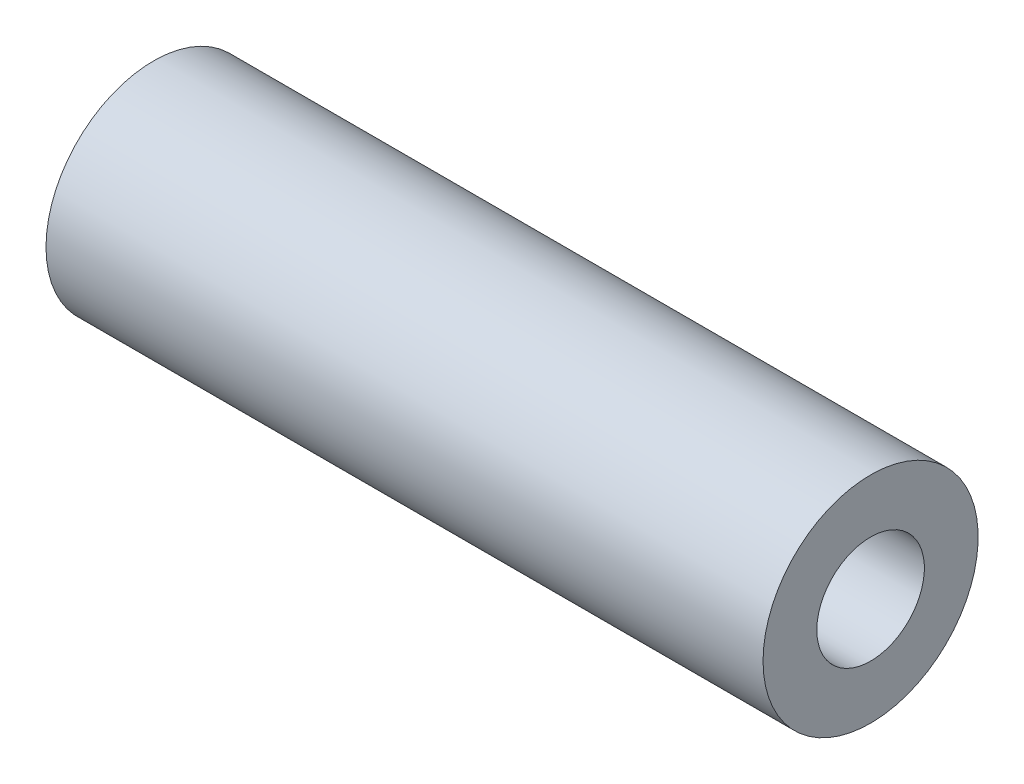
from build123d import *

# Parameters (mm, degrees)
SKETCH1_W = 127
SKETCH1_H = 9.525


with BuildPart() as part:
    # Sketch1 → Revolve1 (revolve)
    with BuildSketch(Plane.XY, mode=Mode.PRIVATE) as revolve1_sk:
        with Locations((0, 14.2875)):
            Rectangle(SKETCH1_W, SKETCH1_H)
    revolve(revolve1_sk.sketch.rotate(Axis((-115.515487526, 0, 0), (1, 0, 0)), 90), axis=Axis((-115.515487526, 0, 0), (1, 0, 0)))


solid = part.part
